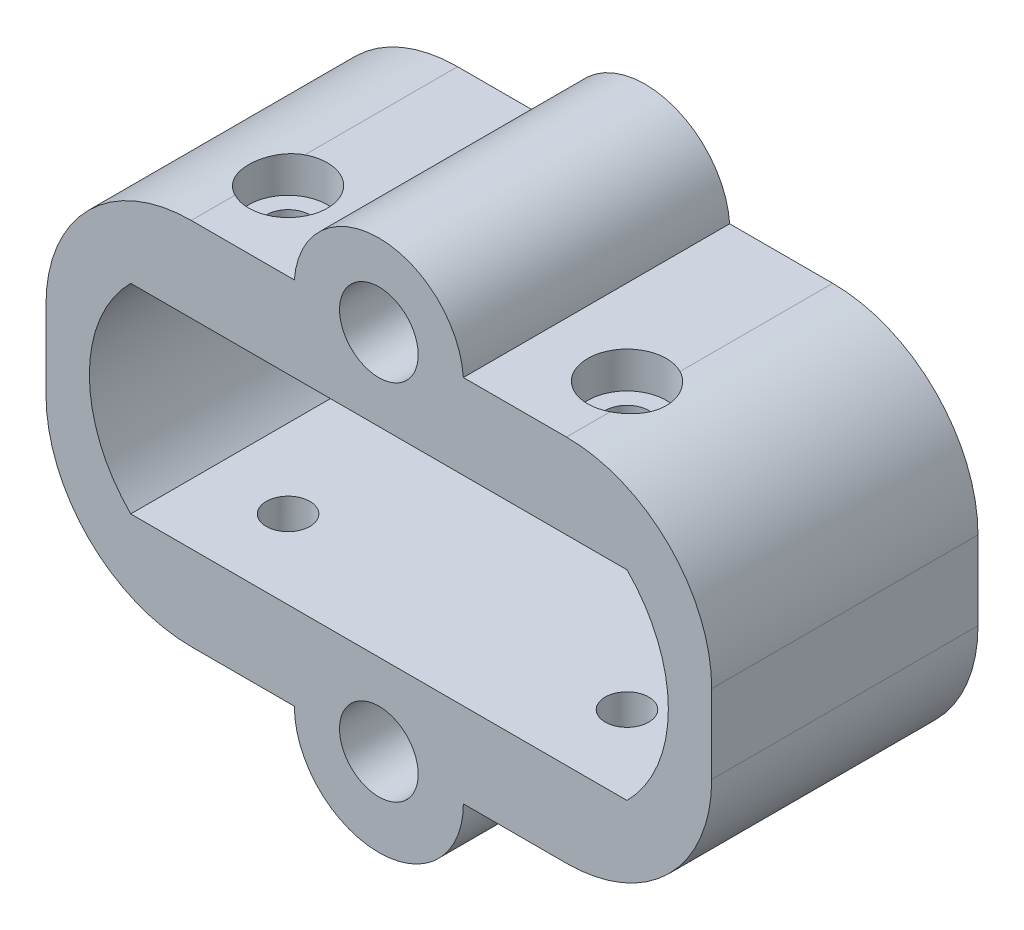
from build123d import *

# Parameters (mm, degrees)
BOSS_EXTRUDE1_DEPTH            = 22
CBORE_FOR_M3_SHCS1_D           = 3.6
CBORE_FOR_M3_SHCS1_CBORE_D     = 6.5
CBORE_FOR_M3_SHCS1_CBORE_DEPTH = 20.5
CBORE_FOR_M3_SHCS2_D           = 3.6
CBORE_FOR_M3_SHCS2_CBORE_D     = 6.5
CBORE_FOR_M3_SHCS2_CBORE_DEPTH = 3


with BuildPart() as part:
    # Sketch1 → Boss-Extrude1 (new body)
    with BuildSketch(Plane.XY):
        with BuildLine():
            Line((-15.5, 15.25), (-6.982120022, 15.25))
            ThreePointArc((-6.982120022, 15.25), (0, 21.75), (6.982120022, 15.25))
            Line((6.982120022, 15.25), (15.5, 15.25))
            ThreePointArc((15.5, 15.25), (23.985281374, 11.735281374), (27.5, 3.25))
            Line((27.5, 3.25), (27.5, -3.25))
            ThreePointArc((27.5, -3.25), (23.985281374, -11.735281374), (15.5, -15.25))
            Line((15.5, -15.25), (6.982120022, -15.25))
            ThreePointArc((6.982120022, -15.25), (0, -22.232120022), (-6.982120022, -15.25))
            Line((-6.982120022, -15.25), (-15.5, -15.25))
            ThreePointArc((-15.5, -15.25), (-23.985281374, -11.735281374), (-27.5, -3.25))
            Line((-27.5, -3.25), (-27.5, 3.25))
            ThreePointArc((-27.5, 3.25), (-23.985281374, 11.735281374), (-15.5, 15.25))
        make_face()
        with BuildLine():
            Line((-20.5, -8.25), (20.5, -8.25))
            ThreePointArc((20.5, -8.25), (23.91726189, 0), (20.5, 8.25))
            Line((20.5, 8.25), (-20.5, 8.25))
            ThreePointArc((-20.5, 8.25), (-23.91726189, 0), (-20.5, -8.25))
        make_face(mode=Mode.SUBTRACT)
    extrude(amount=BOSS_EXTRUDE1_DEPTH)

    # CBORE for M3 SHCS1 (through all)
    with Locations(Plane.XY.offset(22)):
        with Locations((0, 15), (0, -15)):
            CounterBoreHole(CBORE_FOR_M3_SHCS1_D / 2, CBORE_FOR_M3_SHCS1_CBORE_D / 2, CBORE_FOR_M3_SHCS1_CBORE_DEPTH)

    # CBORE for M3 SHCS2 (through all)
    with Locations(Plane(origin=(0, 15.25, 0), x_dir=(1, 0, 0), z_dir=(0, 1, 0))):
        with Locations((14, -15.5), (-14, -15.5)):
            CounterBoreHole(CBORE_FOR_M3_SHCS2_D / 2, CBORE_FOR_M3_SHCS2_CBORE_D / 2, CBORE_FOR_M3_SHCS2_CBORE_DEPTH)


solid = part.part
